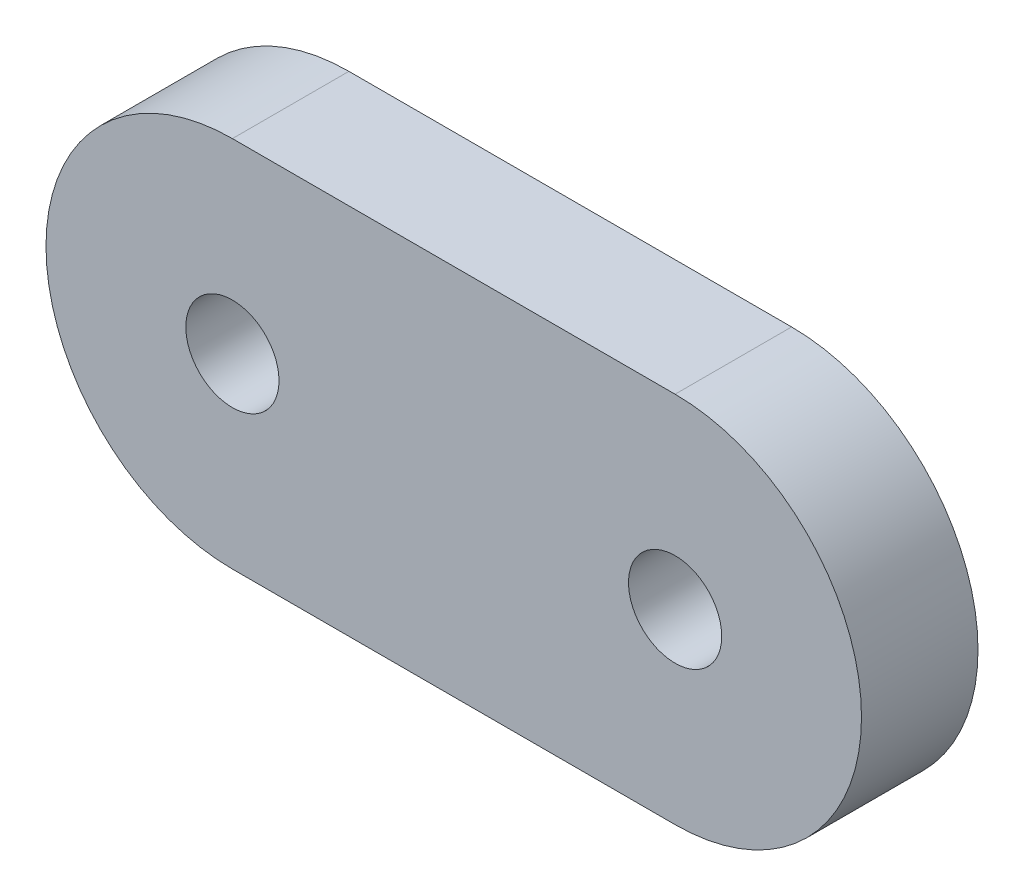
from build123d import *

# Parameters (mm, degrees)
SKETCH1_R           = 2.54
BOSS_EXTRUDE1_DEPTH = 6.35


with BuildPart() as part:
    # Sketch1 → Boss-Extrude1 (new body)
    with BuildSketch(Plane.XY):
        with BuildLine():
            Line((0, 10.16), (24.13, 10.16))
            ThreePointArc((24.13, 10.16), (34.29, 0), (24.13, -10.16))
            Line((24.13, -10.16), (0, -10.16))
            ThreePointArc((0, -10.16), (-10.16, 0), (0, 10.16))
        make_face()
        Circle(SKETCH1_R, mode=Mode.SUBTRACT)
        with Locations((24.13, 0)):
            Circle(SKETCH1_R, mode=Mode.SUBTRACT)
    extrude(amount=BOSS_EXTRUDE1_DEPTH)


solid = part.part
